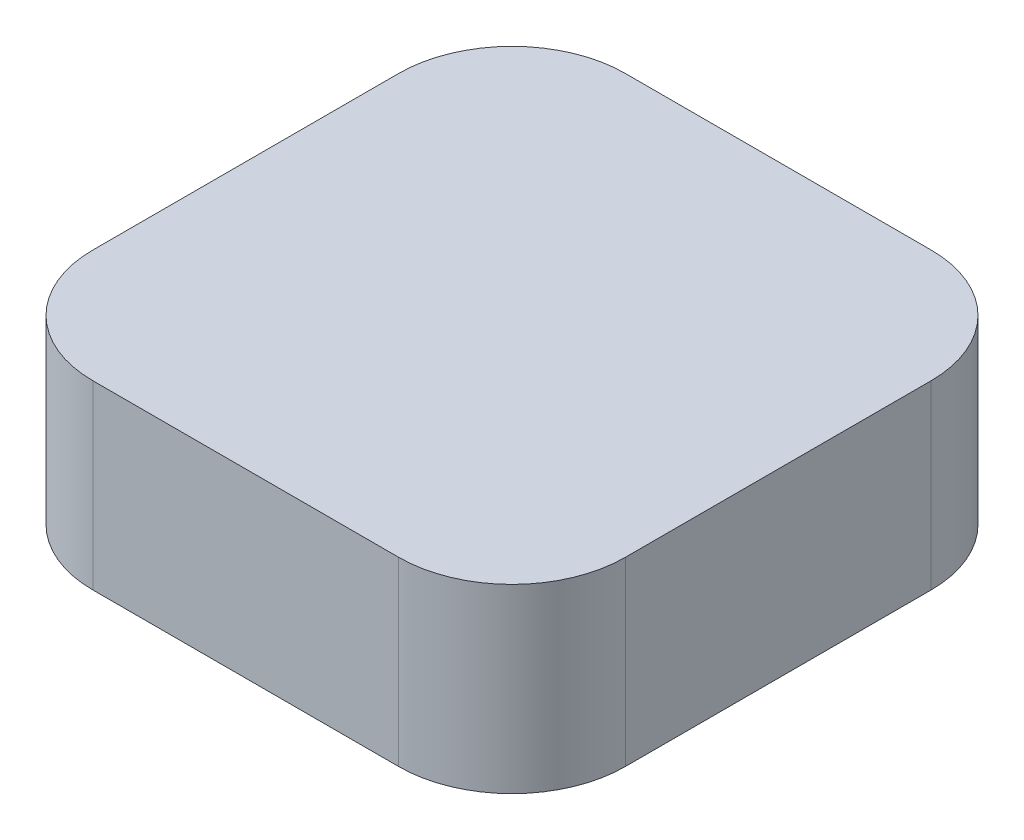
from build123d import *

# Parameters (mm, degrees)
SKETCH_1_W      = 4.7
SKETCH_1_H      = 4.7
EXTRUDE_1_DEPTH = 1.6
FILLET_1_R      = 1


with BuildPart() as part:
    # Sketch 1 → Extrude 1 (new body)
    with BuildSketch(Plane(origin=(0, 0, 0), x_dir=(1, 0, 0), z_dir=(0, 1, 0))):
        Rectangle(SKETCH_1_W, SKETCH_1_H)
    extrude(amount=EXTRUDE_1_DEPTH)

    # Fillet 1
    fillet_1_edges = [part.edges().sort_by_distance(p)[0] for p in [
        (2.35, 0.8, 2.35),
        (-2.35, 0.8, 2.35),
        (-2.35, 0.8, -2.35),
        (2.35, 0.8, -2.35),
    ]]
    fillet(fillet_1_edges, radius=FILLET_1_R)


solid = part.part
